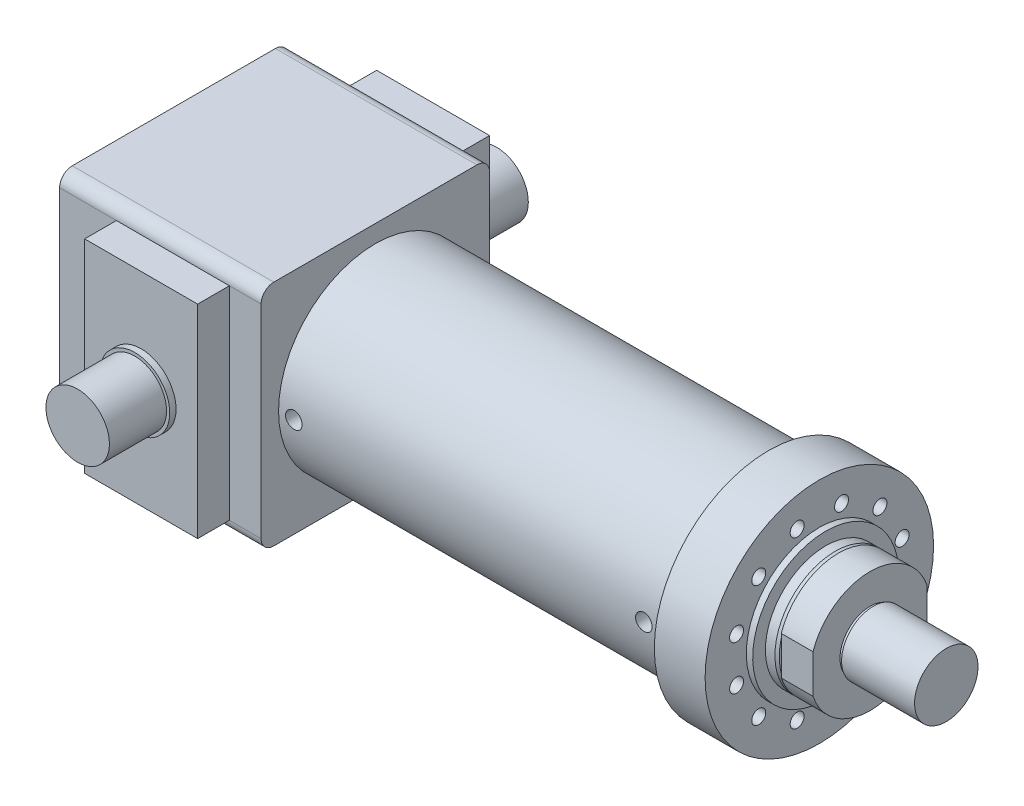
from build123d import *

# Parameters (mm, degrees)
SKETCH_2_W          = 619.5
SKETCH_2_H          = 152.5
SKETCH_3_R          = 180
SKETCH_3_R_2        = 11
EXTRUDE_1_DEPTH     = 80
SKETCH_17_R         = 13
CUT_EXTRUDE_6_DEPTH = 2
SKETCH_23_W         = 360
SKETCH_23_H         = 360
EXTRUDE_8_DEPTH     = 50
SKETCH_28_W         = 360
SKETCH_28_H         = 360
EXTRUDE_12_DEPTH    = 178
SKETCH_29_W         = 360
SKETCH_29_H         = 360
EXTRUDE_13_DEPTH    = 89.5
FILLET_3_R          = 20
SKETCH_19_R         = 13
CUT_EXTRUDE_9_DEPTH = 100
FILLET_5_R          = 20
FILLET_6_R          = 20
SKETCH_44_R         = 115
EXTRUDE_28_DEPTH    = 10
SKETCH_45_R         = 95
EXTRUDE_29_DEPTH    = 20
CHAMFER_2_SIZE      = 5
CHAMFER_2_SIZE2     = 1.819851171
EXTRUDE_30_DEPTH    = 50
SKETCH_47_R         = 47.5
EXTRUDE_31_DEPTH    = 5
SKETCH_48_R         = 50
EXTRUDE_32_DEPTH    = 115
SKETCH_49_W         = 178
SKETCH_49_H         = 320
EXTRUDE_33_DEPTH    = 50
EXTRUDE_START       = -360
SKETCH_49_2_W       = 178
SKETCH_49_2_H       = 320
EXTRUDE_34_DEPTH    = 50
SKETCH_50_R         = 50
EXTRUDE_35_DEPTH    = 100
EXTRUDE_START_2     = -560
SKETCH_50_2_R       = 50
EXTRUDE_36_DEPTH    = 100
SKETCH_51_R         = 55
SKETCH_51_R_2       = 50
EXTRUDE_37_DEPTH    = 10
EXTRUDE_START_3     = -470
SKETCH_51_2_R       = 55
SKETCH_51_2_R_2     = 50
EXTRUDE_38_DEPTH    = 10


with BuildPart() as part:
    # Sketch 2 → Revolve 1 (revolve)
    with BuildSketch(Plane.XY):
        with Locations((309.75, 76.25)):
            Rectangle(SKETCH_2_W, SKETCH_2_H)
    revolve(axis=Axis((619.5, 0, 0), (-1, 0, 0)))

    # Sketch 3 → Extrude 1 (add)
    with BuildSketch(Plane(origin=(619.5, 0, 0), x_dir=(0, 0, -1), z_dir=(1, 0, 0))):
        with Locations(Location((0, 0, 0), (0, 0, 90))):
            Circle(SKETCH_3_R)
        with Locations(Location((130.399986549, 34.940571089, 0), (0, 0, 90))):
            Circle(SKETCH_3_R_2, mode=Mode.SUBTRACT)
        with Locations(Location((130.399986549, -34.940571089, 0), (0, 0, 90))):
            Circle(SKETCH_3_R_2, mode=Mode.SUBTRACT)
        with Locations(Location((95.45941546, -95.45941546, 0), (0, 0, 90))):
            Circle(SKETCH_3_R_2, mode=Mode.SUBTRACT)
        with Locations(Location((34.940571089, -130.399986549, 0), (0, 0, 90))):
            Circle(SKETCH_3_R_2, mode=Mode.SUBTRACT)
        with Locations(Location((-34.940571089, -130.399986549, 0), (0, 0, 90))):
            Circle(SKETCH_3_R_2, mode=Mode.SUBTRACT)
        with Locations(Location((-95.45941546, -95.45941546, 0), (0, 0, 90))):
            Circle(SKETCH_3_R_2, mode=Mode.SUBTRACT)
        with Locations(Location((-130.399986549, -34.940571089, 0), (0, 0, 90))):
            Circle(SKETCH_3_R_2, mode=Mode.SUBTRACT)
        with Locations(Location((-130.399986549, 34.940571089, 0), (0, 0, 90))):
            Circle(SKETCH_3_R_2, mode=Mode.SUBTRACT)
        with Locations(Location((-95.45941546, 95.45941546, 0), (0, 0, 90))):
            Circle(SKETCH_3_R_2, mode=Mode.SUBTRACT)
        with Locations(Location((-34.940571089, 130.399986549, 0), (0, 0, 90))):
            Circle(SKETCH_3_R_2, mode=Mode.SUBTRACT)
        with Locations(Location((34.940571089, 130.399986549, 0), (0, 0, 90))):
            Circle(SKETCH_3_R_2, mode=Mode.SUBTRACT)
        with Locations(Location((95.45941546, 95.45941546, 0), (0, 0, 90))):
            Circle(SKETCH_3_R_2, mode=Mode.SUBTRACT)
    extrude(amount=EXTRUDE_1_DEPTH)

    # Sketch 17 → Cut-Extrude 6 (cut)
    with BuildSketch(Plane.XY.offset(-152.5)):
        with Locations(Location((44, 0, 0), (0, 0, 180))):
            Circle(SKETCH_17_R)
    extrude(amount=CUT_EXTRUDE_6_DEPTH, mode=Mode.SUBTRACT)

    # Sketch 23 → Extrude 8 (add)
    with BuildSketch(Plane.ZY):
        Rectangle(SKETCH_23_W, SKETCH_23_H)
    extrude(amount=EXTRUDE_8_DEPTH)

    # Sketch 19 → Cut-Extrude 9 (cut)
    with BuildSketch(Plane.XY.offset(152.5)):
        with Locations((24, 0)):
            Circle(SKETCH_19_R)
        with Locations((575.5, 0)):
            Circle(SKETCH_19_R)
    extrude(amount=-CUT_EXTRUDE_9_DEPTH, mode=Mode.SUBTRACT)

    # Fillet 6
    fillet_6_edges = [part.edges().sort_by_distance(p)[0] for p in [
        (-25, -180, 180),
        (-25, 180, 180),
        (-25, 180, -180),
        (-25, -180, -180),
    ]]
    fillet(fillet_6_edges, radius=FILLET_6_R)



with BuildPart() as body_2:
    # Sketch 28 → Extrude 12 (new body)
    with BuildSketch(Plane.ZY.offset(50)):
        Rectangle(SKETCH_28_W, SKETCH_28_H)
    extrude(amount=EXTRUDE_12_DEPTH)

    # Fillet 5
    fillet_5_edges = [body_2.edges().sort_by_distance(p)[0] for p in [
        (-139, -180, 180),
        (-139, -180, -180),
        (-139, 180, -180),
        (-139, 180, 180),
    ]]
    fillet(fillet_5_edges, radius=FILLET_5_R)


with BuildPart() as body_3:
    # Sketch 29 → Extrude 13 (new body)
    with BuildSketch(Plane.ZY.offset(228)):
        Rectangle(SKETCH_29_W, SKETCH_29_H)
    extrude(amount=EXTRUDE_13_DEPTH)

    # Fillet 3
    fillet_3_edges = [body_3.edges().sort_by_distance(p)[0] for p in [
        (-272.75, -180, 180),
        (-272.75, -180, -180),
        (-272.75, 180, -180),
        (-272.75, 180, 180),
    ]]
    fillet(fillet_3_edges, radius=FILLET_3_R)


with BuildPart() as body_4:
    # Sketch 44 → Extrude 28 (new body)
    with BuildSketch(Plane(origin=(699.5, 0, 0), x_dir=(0, 0, -1), z_dir=(1, 0, 0))):
        with Locations(Location((0, 0, 0), (0, 0, 90))):
            Circle(SKETCH_44_R)
    extrude(amount=EXTRUDE_28_DEPTH)


with BuildPart() as body_5:
    # Sketch 45 → Extrude 29 (new body)
    with BuildSketch(Plane(origin=(709.5, 0, 0), x_dir=(0, 0, -1), z_dir=(1, 0, 0))):
        with Locations(Location((0, 0, 0), (0, 0, 90))):
            Circle(SKETCH_45_R)
    extrude(amount=EXTRUDE_29_DEPTH)

    # Chamfer 2
    chamfer_2_edges = [body_5.edges().sort_by_distance(p)[0] for p in [
        (729.5, -95, 0),
    ]]
    chamfer_2_side = [body_5.faces().sort_by_distance(p)[0] for p in [
        (719.5, -95, 0),
    ]]
    chamfer(chamfer_2_edges, length=CHAMFER_2_SIZE, length2=CHAMFER_2_SIZE2, reference=chamfer_2_side[0])


with BuildPart() as body_6:
    # Sketch 46 → Extrude 30 (new body)
    with BuildSketch(Plane(origin=(729.5, 0, 0), x_dir=(0, 0, -1), z_dir=(1, 0, 0))):
        with BuildLine():
            Line((-90, 30.413812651), (-90, -30.413812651))
            ThreePointArc((-90, -30.413812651), (0, -95), (90, -30.413812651))
            Line((90, -30.413812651), (90, 30.413812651))
            ThreePointArc((90, 30.413812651), (0, 95), (-90, 30.413812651))
        make_face()
    extrude(amount=EXTRUDE_30_DEPTH)

    # Sketch 47 → Extrude 31 (add)
    with BuildSketch(Plane(origin=(779.5, 0, 0), x_dir=(0, 0, -1), z_dir=(1, 0, 0))):
        with Locations(Location((0, 0, 0), (0, 0, 90))):
            Circle(SKETCH_47_R)
    extrude(amount=EXTRUDE_31_DEPTH)

    # Sketch 48 → Extrude 32 (add)
    with BuildSketch(Plane(origin=(784.5, 0, 0), x_dir=(0, 0, -1), z_dir=(1, 0, 0))):
        with Locations(Location((0, 0, 0), (0, 0, 90))):
            Circle(SKETCH_48_R)
    extrude(amount=EXTRUDE_32_DEPTH)


with BuildPart() as part_1:
    add(part.part)

    add(body_2.part)  # Extrude 33 merges body 2

    add(body_3.part)  # Extrude 33 merges body 3
    # Sketch 49 → Extrude 33 (add)
    with BuildSketch(Plane.XY.offset(180)):
        with Locations((-139, 0)):
            Rectangle(SKETCH_49_W, SKETCH_49_H)
    extrude(amount=EXTRUDE_33_DEPTH)

    # Sketch 49_2 → Extrude 34 (add)
    with BuildSketch(Plane.XY.offset(180).offset(EXTRUDE_START)):
        with Locations((-139, 0)):
            Rectangle(SKETCH_49_2_W, SKETCH_49_2_H)
    extrude(amount=-EXTRUDE_34_DEPTH)

    # Sketch 50 → Extrude 35 (add)
    with BuildSketch(Plane.XY.offset(230)):
        with Locations((-139, -0.426720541)):
            Circle(SKETCH_50_R)
    extrude(amount=EXTRUDE_35_DEPTH)

    # Sketch 50_2 → Extrude 36 (add)
    with BuildSketch(Plane.XY.offset(230).offset(EXTRUDE_START_2)):
        with Locations((-139, -0.426720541)):
            Circle(SKETCH_50_2_R)
    extrude(amount=EXTRUDE_36_DEPTH)

    # Sketch 51 → Extrude 37 (add)
    with BuildSketch(Plane.XY.offset(230)):
        with Locations((-139, -0.426720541)):
            Circle(SKETCH_51_R)
        with Locations((-139, -0.426720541)):
            Circle(SKETCH_51_R_2, mode=Mode.SUBTRACT)
    extrude(amount=EXTRUDE_37_DEPTH)

    # Sketch 51_2 → Extrude 38 (add)
    with BuildSketch(Plane.XY.offset(230).offset(EXTRUDE_START_3)):
        with Locations((-139, -0.426720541)):
            Circle(SKETCH_51_2_R)
        with Locations((-139, -0.426720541)):
            Circle(SKETCH_51_2_R_2, mode=Mode.SUBTRACT)
    extrude(amount=EXTRUDE_38_DEPTH)


solid = Compound([body_4.part, body_5.part, body_6.part, part_1.part])
